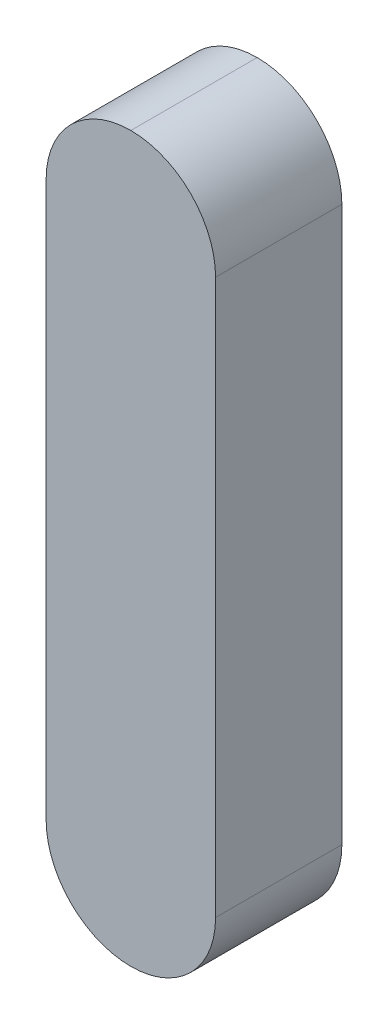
ISO-10303-21;
HEADER;
FILE_DESCRIPTION(('STEP AP214'),'2;1');
FILE_NAME('part.step','',(''),(''),'','','');
FILE_SCHEMA(('AUTOMOTIVE_DESIGN { 1 0 10303 214 1 1 1 1 }'));
ENDSEC;
DATA;
#1=APPLICATION_CONTEXT('core data for automotive mechanical design processes');
#2=APPLICATION_PROTOCOL_DEFINITION('international standard','automotive_design',2000,#1);
#3=PRODUCT_CONTEXT('',#1,'mechanical');
#4=PRODUCT('Part','Part','',(#3));
#5=PRODUCT_RELATED_PRODUCT_CATEGORY('part','',(#4));
#6=PRODUCT_DEFINITION_FORMATION('','',#4);
#7=PRODUCT_DEFINITION_CONTEXT('part definition',#1,'design');
#8=PRODUCT_DEFINITION('design','',#6,#7);
#9=PRODUCT_DEFINITION_SHAPE('','',#8);
#10=(LENGTH_UNIT() NAMED_UNIT(*) SI_UNIT(.MILLI.,.METRE.));
#11=(NAMED_UNIT(*) PLANE_ANGLE_UNIT() SI_UNIT($,.RADIAN.));
#12=(NAMED_UNIT(*) SI_UNIT($,.STERADIAN.) SOLID_ANGLE_UNIT());
#13=UNCERTAINTY_MEASURE_WITH_UNIT(LENGTH_MEASURE(1.E-05),#10,'distance_accuracy_value','');
#14=(GEOMETRIC_REPRESENTATION_CONTEXT(3) GLOBAL_UNCERTAINTY_ASSIGNED_CONTEXT((#13)) GLOBAL_UNIT_ASSIGNED_CONTEXT((#10,
#11,#12)) REPRESENTATION_CONTEXT('',''));
#15=CARTESIAN_POINT('',(0.,0.,0.));
#16=DIRECTION('',(0.,0.,1.));
#17=DIRECTION('',(1.,0.,0.));
#18=AXIS2_PLACEMENT_3D('',#15,#16,#17);
#19=CARTESIAN_POINT('',(-47.8,-18.5041746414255,4.1));
#20=DIRECTION('',(-1.,0.,0.));
#21=DIRECTION('',(0.,-1.,0.));
#22=AXIS2_PLACEMENT_3D('',#19,#20,#21);
#23=PLANE('',#22);
#24=DIRECTION('',(0.,1.,0.));
#25=VECTOR('',#24,1.);
#26=CARTESIAN_POINT('',(-47.8,-18.5041746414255,4.1));
#27=LINE('',#26,#25);
#28=CARTESIAN_POINT('',(-47.8,-39.2541746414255,4.1));
#29=VERTEX_POINT('',#28);
#30=CARTESIAN_POINT('',(-47.8,-21.2541746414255,4.1));
#31=VERTEX_POINT('',#30);
#32=EDGE_CURVE('E100',#29,#31,#27,.T.);
#33=ORIENTED_EDGE('',*,*,#32,.F.);
#34=DIRECTION('',(0.,0.,-1.));
#35=VECTOR('',#34,1.);
#36=CARTESIAN_POINT('',(-47.8,-39.2541746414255,4.1));
#37=LINE('',#36,#35);
#38=CARTESIAN_POINT('',(-47.8,-39.2541746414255,0.));
#39=VERTEX_POINT('',#38);
#40=EDGE_CURVE('E85',#29,#39,#37,.T.);
#41=ORIENTED_EDGE('',*,*,#40,.T.);
#42=DIRECTION('',(0.,1.,0.));
#43=VECTOR('',#42,1.);
#44=CARTESIAN_POINT('',(-47.8,-18.5041746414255,0.));
#45=LINE('',#44,#43);
#46=CARTESIAN_POINT('',(-47.8,-21.2541746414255,0.));
#47=VERTEX_POINT('',#46);
#48=EDGE_CURVE('E97',#39,#47,#45,.T.);
#49=ORIENTED_EDGE('',*,*,#48,.T.);
#50=DIRECTION('',(0.,0.,-1.));
#51=VECTOR('',#50,1.);
#52=CARTESIAN_POINT('',(-47.8,-21.2541746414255,4.1));
#53=LINE('',#52,#51);
#54=EDGE_CURVE('E102',#47,#31,#53,.F.);
#55=ORIENTED_EDGE('',*,*,#54,.T.);
#56=EDGE_LOOP('',(#33,#41,#49,#55));
#57=FACE_BOUND('',#56,.T.);
#58=ADVANCED_FACE('F29',(#57),#23,.F.);
#59=CARTESIAN_POINT('',(-53.3,-18.5041746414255,4.1));
#60=DIRECTION('',(1.,0.,0.));
#61=DIRECTION('',(0.,1.,0.));
#62=AXIS2_PLACEMENT_3D('',#59,#60,#61);
#63=PLANE('',#62);
#64=DIRECTION('',(0.,-1.,0.));
#65=VECTOR('',#64,1.);
#66=CARTESIAN_POINT('',(-53.3,-18.5041746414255,0.));
#67=LINE('',#66,#65);
#68=CARTESIAN_POINT('',(-53.3,-21.2541746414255,0.));
#69=VERTEX_POINT('',#68);
#70=CARTESIAN_POINT('',(-53.3,-39.2541746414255,0.));
#71=VERTEX_POINT('',#70);
#72=EDGE_CURVE('E107',#69,#71,#67,.T.);
#73=ORIENTED_EDGE('',*,*,#72,.T.);
#74=DIRECTION('',(0.,0.,-1.));
#75=VECTOR('',#74,1.);
#76=CARTESIAN_POINT('',(-53.3,-39.2541746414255,4.1));
#77=LINE('',#76,#75);
#78=CARTESIAN_POINT('',(-53.3,-39.2541746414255,4.1));
#79=VERTEX_POINT('',#78);
#80=EDGE_CURVE('E11',#71,#79,#77,.F.);
#81=ORIENTED_EDGE('',*,*,#80,.T.);
#82=DIRECTION('',(0.,-1.,0.));
#83=VECTOR('',#82,1.);
#84=CARTESIAN_POINT('',(-53.3,-18.5041746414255,4.1));
#85=LINE('',#84,#83);
#86=CARTESIAN_POINT('',(-53.3,-21.2541746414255,4.1));
#87=VERTEX_POINT('',#86);
#88=EDGE_CURVE('E115',#87,#79,#85,.T.);
#89=ORIENTED_EDGE('',*,*,#88,.F.);
#90=DIRECTION('',(0.,0.,-1.));
#91=VECTOR('',#90,1.);
#92=CARTESIAN_POINT('',(-53.3,-21.2541746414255,4.1));
#93=LINE('',#92,#91);
#94=EDGE_CURVE('E36',#87,#69,#93,.T.);
#95=ORIENTED_EDGE('',*,*,#94,.T.);
#96=EDGE_LOOP('',(#73,#81,#89,#95));
#97=FACE_BOUND('',#96,.T.);
#98=ADVANCED_FACE('F128',(#97),#63,.F.);
#99=CARTESIAN_POINT('',(-47.8,-42.0041746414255,4.1));
#100=DIRECTION('',(0.,0.,-1.));
#101=DIRECTION('',(-1.,0.,0.));
#102=AXIS2_PLACEMENT_3D('',#99,#100,#101);
#103=PLANE('',#102);
#104=CARTESIAN_POINT('',(-50.55,-39.2541746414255,4.1));
#105=DIRECTION('',(0.,0.,-1.));
#106=DIRECTION('',(-1.,0.,0.));
#107=AXIS2_PLACEMENT_3D('',#104,#105,#106);
#108=CIRCLE('',#107,2.75);
#109=CARTESIAN_POINT('',(-50.55,-42.0041746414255,4.1));
#110=VERTEX_POINT('',#109);
#111=EDGE_CURVE('E43',#79,#110,#108,.F.);
#112=ORIENTED_EDGE('',*,*,#111,.T.);
#113=CARTESIAN_POINT('',(-50.55,-39.2541746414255,4.1));
#114=DIRECTION('',(0.,0.,-1.));
#115=DIRECTION('',(-1.,0.,0.));
#116=AXIS2_PLACEMENT_3D('',#113,#114,#115);
#117=CIRCLE('',#116,2.75);
#118=EDGE_CURVE('E125',#110,#29,#117,.F.);
#119=ORIENTED_EDGE('',*,*,#118,.T.);
#120=ORIENTED_EDGE('',*,*,#32,.T.);
#121=CARTESIAN_POINT('',(-50.55,-21.2541746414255,4.1));
#122=DIRECTION('',(0.,0.,-1.));
#123=DIRECTION('',(-1.,0.,0.));
#124=AXIS2_PLACEMENT_3D('',#121,#122,#123);
#125=CIRCLE('',#124,2.75);
#126=CARTESIAN_POINT('',(-50.55,-18.5041746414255,4.1));
#127=VERTEX_POINT('',#126);
#128=EDGE_CURVE('E122',#31,#127,#125,.F.);
#129=ORIENTED_EDGE('',*,*,#128,.T.);
#130=CARTESIAN_POINT('',(-50.55,-21.2541746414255,4.1));
#131=DIRECTION('',(0.,0.,-1.));
#132=DIRECTION('',(-1.,0.,0.));
#133=AXIS2_PLACEMENT_3D('',#130,#131,#132);
#134=CIRCLE('',#133,2.75);
#135=EDGE_CURVE('E90',#127,#87,#134,.F.);
#136=ORIENTED_EDGE('',*,*,#135,.T.);
#137=ORIENTED_EDGE('',*,*,#88,.T.);
#138=EDGE_LOOP('',(#112,#119,#120,#129,#136,#137));
#139=FACE_BOUND('',#138,.T.);
#140=ADVANCED_FACE('F137',(#139),#103,.F.);
#141=CARTESIAN_POINT('',(-47.8,-42.0041746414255,0.));
#142=DIRECTION('',(0.,0.,-1.));
#143=DIRECTION('',(-1.,0.,0.));
#144=AXIS2_PLACEMENT_3D('',#141,#142,#143);
#145=PLANE('',#144);
#146=ORIENTED_EDGE('',*,*,#48,.F.);
#147=CARTESIAN_POINT('',(-50.55,-39.2541746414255,0.));
#148=DIRECTION('',(0.,0.,-1.));
#149=DIRECTION('',(-1.,0.,0.));
#150=AXIS2_PLACEMENT_3D('',#147,#148,#149);
#151=CIRCLE('',#150,2.75);
#152=CARTESIAN_POINT('',(-50.55,-42.0041746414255,0.));
#153=VERTEX_POINT('',#152);
#154=EDGE_CURVE('E81',#39,#153,#151,.T.);
#155=ORIENTED_EDGE('',*,*,#154,.T.);
#156=CARTESIAN_POINT('',(-50.55,-39.2541746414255,0.));
#157=DIRECTION('',(0.,0.,-1.));
#158=DIRECTION('',(-1.,0.,0.));
#159=AXIS2_PLACEMENT_3D('',#156,#157,#158);
#160=CIRCLE('',#159,2.75);
#161=EDGE_CURVE('E91',#153,#71,#160,.T.);
#162=ORIENTED_EDGE('',*,*,#161,.T.);
#163=ORIENTED_EDGE('',*,*,#72,.F.);
#164=CARTESIAN_POINT('',(-50.55,-21.2541746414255,0.));
#165=DIRECTION('',(0.,0.,-1.));
#166=DIRECTION('',(-1.,0.,0.));
#167=AXIS2_PLACEMENT_3D('',#164,#165,#166);
#168=CIRCLE('',#167,2.75);
#169=CARTESIAN_POINT('',(-50.55,-18.5041746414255,0.));
#170=VERTEX_POINT('',#169);
#171=EDGE_CURVE('E101',#69,#170,#168,.T.);
#172=ORIENTED_EDGE('',*,*,#171,.T.);
#173=CARTESIAN_POINT('',(-50.55,-21.2541746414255,0.));
#174=DIRECTION('',(0.,0.,-1.));
#175=DIRECTION('',(-1.,0.,0.));
#176=AXIS2_PLACEMENT_3D('',#173,#174,#175);
#177=CIRCLE('',#176,2.75);
#178=EDGE_CURVE('E106',#170,#47,#177,.T.);
#179=ORIENTED_EDGE('',*,*,#178,.T.);
#180=EDGE_LOOP('',(#146,#155,#162,#163,#172,#179));
#181=FACE_BOUND('',#180,.T.);
#182=ADVANCED_FACE('F104',(#181),#145,.T.);
#183=CARTESIAN_POINT('',(-50.55,-39.2541746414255,4.1));
#184=DIRECTION('',(0.,0.,-1.));
#185=DIRECTION('',(-1.,0.,0.));
#186=AXIS2_PLACEMENT_3D('',#183,#184,#185);
#187=CYLINDRICAL_SURFACE('',#186,2.75);
#188=DIRECTION('',(0.,0.,-1.));
#189=VECTOR('',#188,1.);
#190=CARTESIAN_POINT('',(-50.55,-42.0041746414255,4.1));
#191=LINE('',#190,#189);
#192=EDGE_CURVE('E86',#110,#153,#191,.T.);
#193=ORIENTED_EDGE('',*,*,#192,.F.);
#194=ORIENTED_EDGE('',*,*,#111,.F.);
#195=ORIENTED_EDGE('',*,*,#80,.F.);
#196=ORIENTED_EDGE('',*,*,#161,.F.);
#197=EDGE_LOOP('',(#193,#194,#195,#196));
#198=FACE_BOUND('',#197,.T.);
#199=ADVANCED_FACE('F139',(#198),#187,.T.);
#200=CARTESIAN_POINT('',(-50.55,-39.2541746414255,4.1));
#201=DIRECTION('',(0.,0.,-1.));
#202=DIRECTION('',(-1.,0.,0.));
#203=AXIS2_PLACEMENT_3D('',#200,#201,#202);
#204=CYLINDRICAL_SURFACE('',#203,2.75);
#205=ORIENTED_EDGE('',*,*,#118,.F.);
#206=ORIENTED_EDGE('',*,*,#192,.T.);
#207=ORIENTED_EDGE('',*,*,#154,.F.);
#208=ORIENTED_EDGE('',*,*,#40,.F.);
#209=EDGE_LOOP('',(#205,#206,#207,#208));
#210=FACE_BOUND('',#209,.T.);
#211=ADVANCED_FACE('F84',(#210),#204,.T.);
#212=CARTESIAN_POINT('',(-50.55,-21.2541746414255,4.1));
#213=DIRECTION('',(0.,0.,-1.));
#214=DIRECTION('',(-1.,0.,0.));
#215=AXIS2_PLACEMENT_3D('',#212,#213,#214);
#216=CYLINDRICAL_SURFACE('',#215,2.75);
#217=ORIENTED_EDGE('',*,*,#94,.F.);
#218=ORIENTED_EDGE('',*,*,#135,.F.);
#219=DIRECTION('',(0.,0.,-1.));
#220=VECTOR('',#219,1.);
#221=CARTESIAN_POINT('',(-50.55,-18.5041746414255,4.1));
#222=LINE('',#221,#220);
#223=EDGE_CURVE('E110',#170,#127,#222,.F.);
#224=ORIENTED_EDGE('',*,*,#223,.F.);
#225=ORIENTED_EDGE('',*,*,#171,.F.);
#226=EDGE_LOOP('',(#217,#218,#224,#225));
#227=FACE_BOUND('',#226,.T.);
#228=ADVANCED_FACE('F133',(#227),#216,.T.);
#229=CARTESIAN_POINT('',(-50.55,-21.2541746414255,4.1));
#230=DIRECTION('',(0.,0.,-1.));
#231=DIRECTION('',(-1.,0.,0.));
#232=AXIS2_PLACEMENT_3D('',#229,#230,#231);
#233=CYLINDRICAL_SURFACE('',#232,2.75);
#234=ORIENTED_EDGE('',*,*,#128,.F.);
#235=ORIENTED_EDGE('',*,*,#54,.F.);
#236=ORIENTED_EDGE('',*,*,#178,.F.);
#237=ORIENTED_EDGE('',*,*,#223,.T.);
#238=EDGE_LOOP('',(#234,#235,#236,#237));
#239=FACE_BOUND('',#238,.T.);
#240=ADVANCED_FACE('F136',(#239),#233,.T.);
#241=CLOSED_SHELL('',(#58,#98,#140,#182,#199,#211,#228,#240));
#242=MANIFOLD_SOLID_BREP('B2',#241);
#243=ADVANCED_BREP_SHAPE_REPRESENTATION('',(#18,#242),#14);
#244=SHAPE_DEFINITION_REPRESENTATION(#9,#243);
ENDSEC;
END-ISO-10303-21;
